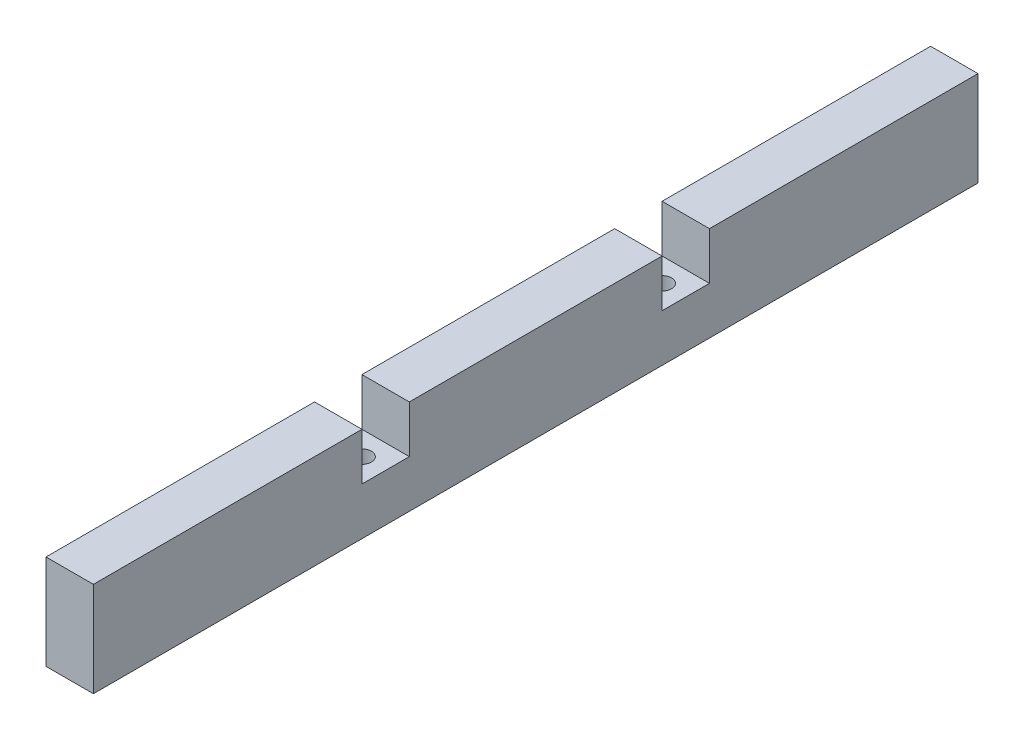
from build123d import *

# Parameters (mm, degrees)
ESQUISSE1_W             = 15
ESQUISSE1_H             = 30
BOSS_EXTRU_1_DEPTH      = 140
ESQUISSE2_W             = 15
ESQUISSE2_H             = 15
ENL_V_MAT_EXTRU_1_DEPTH = 144.961800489
ESQUISSE3_R             = 3
ENL_V_MAT_EXTRU_2_DEPTH = 142.598022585


with BuildPart() as part:
    # Esquisse1 → Boss.-Extru.1 (new, symmetric)
    with BuildSketch(Plane.XY):
        with Locations((-7.5, 15)):
            Rectangle(ESQUISSE1_W, ESQUISSE1_H)
    extrude(amount=BOSS_EXTRU_1_DEPTH, both=True)

    # Esquisse2 → Enl_v. mat.-Extru.1 (cut, through all)
    with BuildSketch(Plane(origin=(0, 0, 0), x_dir=(0, 0, -1), z_dir=(1, 0, 0))):
        with Locations((47.5, 22.5)):
            Rectangle(ESQUISSE2_W, ESQUISSE2_H)
    enl_v_mat_extru_1 = extrude(amount=-ENL_V_MAT_EXTRU_1_DEPTH, mode=Mode.SUBTRACT)

    # Esquisse3 → Enl_v. mat.-Extru.2 (cut, through all)
    with BuildSketch(Plane(origin=(0, 15, 0), x_dir=(1, 0, 0), z_dir=(0, 1, 0))):
        with Locations(Location((-7.5, 47.5, 0), (0, 0, 270))):
            Circle(ESQUISSE3_R)
    enl_v_mat_extru_2 = extrude(amount=-ENL_V_MAT_EXTRU_2_DEPTH, mode=Mode.SUBTRACT)

    # Sym_trie1: Enl_v. mat.-Extru.1, Enl_v. mat.-Extru.2 across plane
    add(enl_v_mat_extru_1.mirror(Plane.XY), mode=Mode.SUBTRACT)
    add(enl_v_mat_extru_2.mirror(Plane.XY), mode=Mode.SUBTRACT)


solid = part.part
